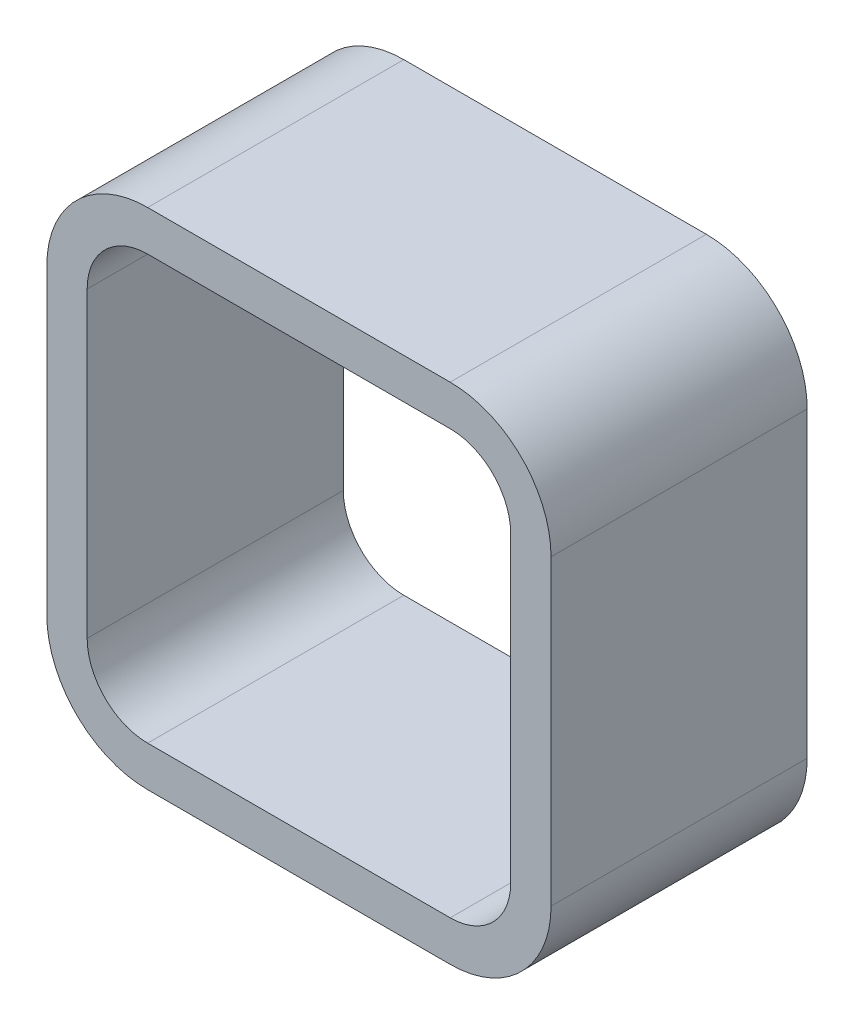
from build123d import *

# Parameters (mm, degrees)
BASESECTION_DEPTH = 12.7


with BuildPart() as part:
    # Sketch1 → BaseSection (new, symmetric)
    with BuildSketch(Plane.XY):
        with BuildLine():
            Line((-15, -25), (15, -25))
            ThreePointArc((15, -25), (22.071067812, -22.071067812), (25, -15))
            Line((25, -15), (25, 15))
            ThreePointArc((25, 15), (22.071067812, 22.071067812), (15, 25))
            Line((15, 25), (-15, 25))
            ThreePointArc((-15, 25), (-22.071067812, 22.071067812), (-25, 15))
            Line((-25, 15), (-25, -15))
            ThreePointArc((-25, -15), (-22.071067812, -22.071067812), (-15, -25))
        make_face()
        with BuildLine():
            Line((-15, 21), (15, 21))
            ThreePointArc((15, 21), (19.242640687, 19.242640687), (21, 15))
            Line((21, 15), (21, -15))
            ThreePointArc((21, -15), (19.242640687, -19.242640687), (15, -21))
            Line((15, -21), (-15, -21))
            ThreePointArc((-15, -21), (-19.242640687, -19.242640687), (-21, -15))
            Line((-21, -15), (-21, 15))
            ThreePointArc((-21, 15), (-19.242640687, 19.242640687), (-15, 21))
        make_face(mode=Mode.SUBTRACT)
    extrude(amount=BASESECTION_DEPTH, both=True)


solid = part.part
